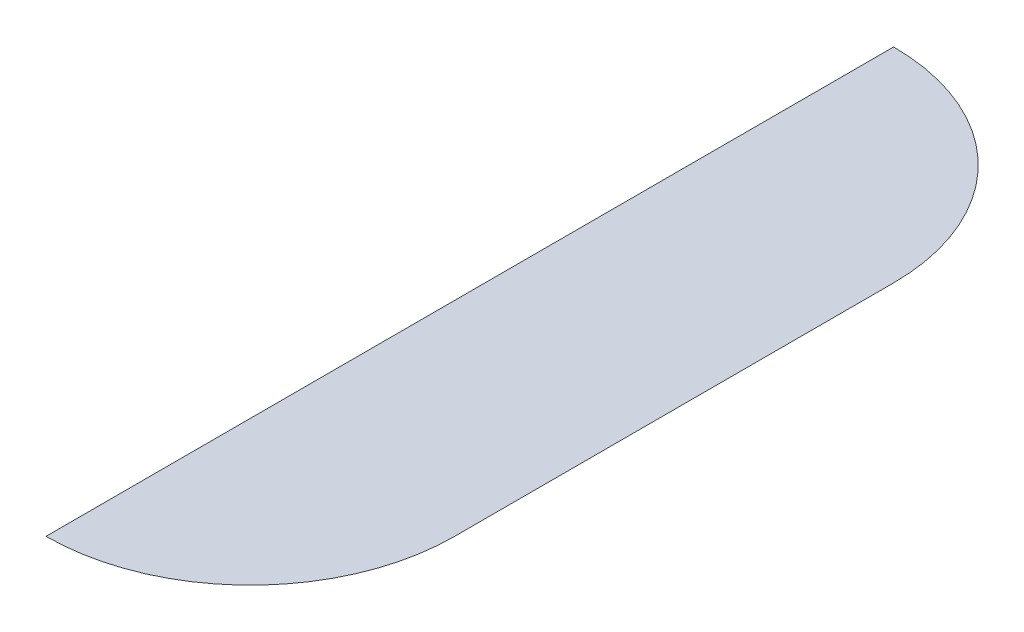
ISO-10303-21;
HEADER;
FILE_DESCRIPTION(('STEP AP214'),'2;1');
FILE_NAME('part.step','',(''),(''),'','','');
FILE_SCHEMA(('AUTOMOTIVE_DESIGN { 1 0 10303 214 1 1 1 1 }'));
ENDSEC;
DATA;
#1=APPLICATION_CONTEXT('core data for automotive mechanical design processes');
#2=APPLICATION_PROTOCOL_DEFINITION('international standard','automotive_design',2000,#1);
#3=PRODUCT_CONTEXT('',#1,'mechanical');
#4=PRODUCT('Part','Part','',(#3));
#5=PRODUCT_RELATED_PRODUCT_CATEGORY('part','',(#4));
#6=PRODUCT_DEFINITION_FORMATION('','',#4);
#7=PRODUCT_DEFINITION_CONTEXT('part definition',#1,'design');
#8=PRODUCT_DEFINITION('design','',#6,#7);
#9=PRODUCT_DEFINITION_SHAPE('','',#8);
#10=(LENGTH_UNIT() NAMED_UNIT(*) SI_UNIT(.MILLI.,.METRE.));
#11=(NAMED_UNIT(*) PLANE_ANGLE_UNIT() SI_UNIT($,.RADIAN.));
#12=(NAMED_UNIT(*) SI_UNIT($,.STERADIAN.) SOLID_ANGLE_UNIT());
#13=UNCERTAINTY_MEASURE_WITH_UNIT(LENGTH_MEASURE(1.E-05),#10,'distance_accuracy_value','');
#14=(GEOMETRIC_REPRESENTATION_CONTEXT(3) GLOBAL_UNCERTAINTY_ASSIGNED_CONTEXT((#13)) GLOBAL_UNIT_ASSIGNED_CONTEXT((#10,
#11,#12)) REPRESENTATION_CONTEXT('',''));
#15=CARTESIAN_POINT('',(0.,0.,0.));
#16=DIRECTION('',(0.,0.,1.));
#17=DIRECTION('',(1.,0.,0.));
#18=AXIS2_PLACEMENT_3D('',#15,#16,#17);
#19=CARTESIAN_POINT('',(-5.47370000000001,0.,12.7));
#20=DIRECTION('',(1.,0.,0.));
#21=DIRECTION('',(0.,0.,-1.));
#22=AXIS2_PLACEMENT_3D('',#19,#20,#21);
#23=PLANE('',#22);
#24=DIRECTION('',(0.,0.,-1.));
#25=VECTOR('',#24,1.);
#26=CARTESIAN_POINT('',(-5.47370000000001,0.,12.7));
#27=LINE('',#26,#25);
#28=CARTESIAN_POINT('',(-5.47370000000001,0.,24.5248117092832));
#29=VERTEX_POINT('',#28);
#30=CARTESIAN_POINT('',(-5.47370000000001,0.,-24.5248117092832));
#31=VERTEX_POINT('',#30);
#32=EDGE_CURVE('E93',#29,#31,#27,.T.);
#33=ORIENTED_EDGE('',*,*,#32,.T.);
#34=CARTESIAN_POINT('',(-5.47370000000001,-2.0701,-24.5248117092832));
#35=DIRECTION('',(1.,0.,0.));
#36=DIRECTION('',(0.,0.,-1.));
#37=AXIS2_PLACEMENT_3D('',#34,#35,#36);
#38=CIRCLE('',#37,2.0701);
#39=CARTESIAN_POINT('',(-5.47370000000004,-0.591150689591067,-23.0763563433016));
#40=VERTEX_POINT('',#39);
#41=EDGE_CURVE('E11',#31,#40,#38,.T.);
#42=ORIENTED_EDGE('',*,*,#41,.T.);
#43=CARTESIAN_POINT('',(-5.47370000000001,10.0036563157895,-12.7));
#44=DIRECTION('',(-1.,0.,0.));
#45=DIRECTION('',(0.,0.,1.));
#46=AXIS2_PLACEMENT_3D('',#43,#44,#45);
#47=CIRCLE('',#46,14.8296563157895);
#48=CARTESIAN_POINT('',(-5.47370000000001,-4.826,-12.7));
#49=VERTEX_POINT('',#48);
#50=EDGE_CURVE('E126',#40,#49,#47,.T.);
#51=ORIENTED_EDGE('',*,*,#50,.T.);
#52=DIRECTION('',(0.,0.,-1.));
#53=VECTOR('',#52,1.);
#54=CARTESIAN_POINT('',(-5.47370000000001,-4.826,12.7));
#55=LINE('',#54,#53);
#56=CARTESIAN_POINT('',(-5.47370000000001,-4.826,12.7));
#57=VERTEX_POINT('',#56);
#58=EDGE_CURVE('E122',#57,#49,#55,.T.);
#59=ORIENTED_EDGE('',*,*,#58,.F.);
#60=CARTESIAN_POINT('',(-5.47370000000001,10.0036563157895,12.7));
#61=DIRECTION('',(-1.,0.,0.));
#62=DIRECTION('',(0.,0.,1.));
#63=AXIS2_PLACEMENT_3D('',#60,#61,#62);
#64=CIRCLE('',#63,14.8296563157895);
#65=CARTESIAN_POINT('',(-5.47370000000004,-0.591150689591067,23.0763563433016));
#66=VERTEX_POINT('',#65);
#67=EDGE_CURVE('E120',#57,#66,#64,.T.);
#68=ORIENTED_EDGE('',*,*,#67,.T.);
#69=CARTESIAN_POINT('',(-5.47370000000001,-2.0701,24.5248117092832));
#70=DIRECTION('',(1.,0.,0.));
#71=DIRECTION('',(0.,0.,-1.));
#72=AXIS2_PLACEMENT_3D('',#69,#70,#71);
#73=CIRCLE('',#72,2.0701);
#74=EDGE_CURVE('E48',#66,#29,#73,.T.);
#75=ORIENTED_EDGE('',*,*,#74,.T.);
#76=EDGE_LOOP('',(#33,#42,#51,#59,#68,#75));
#77=FACE_BOUND('',#76,.T.);
#78=ADVANCED_FACE('F39',(#77),#23,.F.);
#79=CARTESIAN_POINT('',(-5.47370000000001,10.0036563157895,12.7));
#80=DIRECTION('',(0.,0.,-1.));
#81=DIRECTION('',(-1.,0.,0.));
#82=AXIS2_PLACEMENT_3D('',#79,#80,#81);
#83=CYLINDRICAL_SURFACE('',#82,14.8296563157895);
#84=CARTESIAN_POINT('',(-5.47370000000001,10.0036563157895,-12.7));
#85=DIRECTION('',(0.,0.,-1.));
#86=DIRECTION('',(-1.,0.,0.));
#87=AXIS2_PLACEMENT_3D('',#84,#85,#86);
#88=CIRCLE('',#87,14.8296563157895);
#89=CARTESIAN_POINT('',(4.90265634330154,-0.59115068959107,-12.7));
#90=VERTEX_POINT('',#89);
#91=EDGE_CURVE('E125',#90,#49,#88,.T.);
#92=ORIENTED_EDGE('',*,*,#91,.F.);
#93=DIRECTION('',(0.,0.,-1.));
#94=VECTOR('',#93,1.);
#95=CARTESIAN_POINT('',(4.90265634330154,-0.591150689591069,12.7));
#96=LINE('',#95,#94);
#97=CARTESIAN_POINT('',(4.90265634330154,-0.59115068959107,12.7));
#98=VERTEX_POINT('',#97);
#99=EDGE_CURVE('E114',#90,#98,#96,.F.);
#100=ORIENTED_EDGE('',*,*,#99,.T.);
#101=CARTESIAN_POINT('',(-5.47370000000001,10.0036563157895,12.7));
#102=DIRECTION('',(0.,0.,-1.));
#103=DIRECTION('',(-1.,0.,0.));
#104=AXIS2_PLACEMENT_3D('',#101,#102,#103);
#105=CIRCLE('',#104,14.8296563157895);
#106=EDGE_CURVE('E128',#98,#57,#105,.T.);
#107=ORIENTED_EDGE('',*,*,#106,.T.);
#108=ORIENTED_EDGE('',*,*,#58,.T.);
#109=EDGE_LOOP('',(#92,#100,#107,#108));
#110=FACE_BOUND('',#109,.T.);
#111=ADVANCED_FACE('F134',(#110),#83,.T.);
#112=CARTESIAN_POINT('',(-5.47370000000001,10.0036563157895,12.7));
#113=DIRECTION('',(0.,1.,0.));
#114=DIRECTION('',(0.,0.,-1.));
#115=AXIS2_PLACEMENT_3D('',#112,#113,#114);
#116=SPHERICAL_SURFACE('',#115,14.8296563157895);
#117=ORIENTED_EDGE('',*,*,#106,.F.);
#118=CARTESIAN_POINT('',(-5.47370000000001,-0.591150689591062,12.7));
#119=DIRECTION('',(0.,1.,0.));
#120=DIRECTION('',(0.,0.,1.));
#121=AXIS2_PLACEMENT_3D('',#118,#119,#120);
#122=CIRCLE('',#121,10.3763563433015);
#123=EDGE_CURVE('E97',#98,#66,#122,.F.);
#124=ORIENTED_EDGE('',*,*,#123,.T.);
#125=ORIENTED_EDGE('',*,*,#67,.F.);
#126=EDGE_LOOP('',(#117,#124,#125));
#127=FACE_BOUND('',#126,.T.);
#128=ADVANCED_FACE('F135',(#127),#116,.T.);
#129=CARTESIAN_POINT('',(-5.47370000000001,10.0036563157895,-12.7));
#130=DIRECTION('',(0.,-1.,0.));
#131=DIRECTION('',(0.,0.,-1.));
#132=AXIS2_PLACEMENT_3D('',#129,#130,#131);
#133=SPHERICAL_SURFACE('',#132,14.8296563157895);
#134=ORIENTED_EDGE('',*,*,#50,.F.);
#135=CARTESIAN_POINT('',(-5.47370000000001,-0.591150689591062,-12.7));
#136=DIRECTION('',(0.,1.,0.));
#137=DIRECTION('',(0.,0.,1.));
#138=AXIS2_PLACEMENT_3D('',#135,#136,#137);
#139=CIRCLE('',#138,10.3763563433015);
#140=EDGE_CURVE('E61',#40,#90,#139,.F.);
#141=ORIENTED_EDGE('',*,*,#140,.T.);
#142=ORIENTED_EDGE('',*,*,#91,.T.);
#143=EDGE_LOOP('',(#134,#141,#142));
#144=FACE_BOUND('',#143,.T.);
#145=ADVANCED_FACE('F137',(#144),#133,.T.);
#146=CARTESIAN_POINT('',(-5.47370000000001,-2.0701,-12.7));
#147=DIRECTION('',(0.,1.,0.));
#148=DIRECTION('',(0.,0.,1.));
#149=AXIS2_PLACEMENT_3D('',#146,#147,#148);
#150=TOROIDAL_SURFACE('',#149,11.8248117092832,2.0701);
#151=ORIENTED_EDGE('',*,*,#41,.F.);
#152=CARTESIAN_POINT('',(-5.47370000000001,0.,-12.7));
#153=DIRECTION('',(0.,1.,0.));
#154=DIRECTION('',(0.,0.,1.));
#155=AXIS2_PLACEMENT_3D('',#152,#153,#154);
#156=CIRCLE('',#155,11.8248117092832);
#157=CARTESIAN_POINT('',(6.35111170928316,0.,-12.7));
#158=VERTEX_POINT('',#157);
#159=EDGE_CURVE('E108',#158,#31,#156,.T.);
#160=ORIENTED_EDGE('',*,*,#159,.F.);
#161=CARTESIAN_POINT('',(6.35111170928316,-2.0701,-12.7));
#162=DIRECTION('',(0.,0.,-1.));
#163=DIRECTION('',(-1.,0.,0.));
#164=AXIS2_PLACEMENT_3D('',#161,#162,#163);
#165=CIRCLE('',#164,2.0701);
#166=EDGE_CURVE('E43',#90,#158,#165,.T.);
#167=ORIENTED_EDGE('',*,*,#166,.F.);
#168=ORIENTED_EDGE('',*,*,#140,.F.);
#169=EDGE_LOOP('',(#151,#160,#167,#168));
#170=FACE_BOUND('',#169,.T.);
#171=ADVANCED_FACE('F41',(#170),#150,.F.);
#172=CARTESIAN_POINT('',(6.35111170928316,-2.0701,12.7));
#173=DIRECTION('',(0.,0.,-1.));
#174=DIRECTION('',(-1.,0.,0.));
#175=AXIS2_PLACEMENT_3D('',#172,#173,#174);
#176=CYLINDRICAL_SURFACE('',#175,2.0701);
#177=ORIENTED_EDGE('',*,*,#166,.T.);
#178=DIRECTION('',(0.,0.,-1.));
#179=VECTOR('',#178,1.);
#180=CARTESIAN_POINT('',(6.35111170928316,0.,38.1));
#181=LINE('',#180,#179);
#182=CARTESIAN_POINT('',(6.35111170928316,0.,12.7));
#183=VERTEX_POINT('',#182);
#184=EDGE_CURVE('E91',#183,#158,#181,.T.);
#185=ORIENTED_EDGE('',*,*,#184,.F.);
#186=CARTESIAN_POINT('',(6.35111170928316,-2.0701,12.7));
#187=DIRECTION('',(0.,0.,-1.));
#188=DIRECTION('',(-1.,0.,0.));
#189=AXIS2_PLACEMENT_3D('',#186,#187,#188);
#190=CIRCLE('',#189,2.0701);
#191=EDGE_CURVE('E101',#98,#183,#190,.T.);
#192=ORIENTED_EDGE('',*,*,#191,.F.);
#193=ORIENTED_EDGE('',*,*,#99,.F.);
#194=EDGE_LOOP('',(#177,#185,#192,#193));
#195=FACE_BOUND('',#194,.T.);
#196=ADVANCED_FACE('F106',(#195),#176,.F.);
#197=CARTESIAN_POINT('',(-5.47370000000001,-2.0701,12.7));
#198=DIRECTION('',(0.,1.,0.));
#199=DIRECTION('',(0.,0.,1.));
#200=AXIS2_PLACEMENT_3D('',#197,#198,#199);
#201=TOROIDAL_SURFACE('',#200,11.8248117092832,2.0701);
#202=ORIENTED_EDGE('',*,*,#74,.F.);
#203=ORIENTED_EDGE('',*,*,#123,.F.);
#204=ORIENTED_EDGE('',*,*,#191,.T.);
#205=CARTESIAN_POINT('',(-5.47370000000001,0.,12.7));
#206=DIRECTION('',(0.,1.,0.));
#207=DIRECTION('',(0.,0.,1.));
#208=AXIS2_PLACEMENT_3D('',#205,#206,#207);
#209=CIRCLE('',#208,11.8248117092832);
#210=EDGE_CURVE('E87',#29,#183,#209,.T.);
#211=ORIENTED_EDGE('',*,*,#210,.F.);
#212=EDGE_LOOP('',(#202,#203,#204,#211));
#213=FACE_BOUND('',#212,.T.);
#214=ADVANCED_FACE('F102',(#213),#201,.F.);
#215=CARTESIAN_POINT('',(15.,0.,-38.1));
#216=DIRECTION('',(0.,-1.,0.));
#217=DIRECTION('',(0.,0.,-1.));
#218=AXIS2_PLACEMENT_3D('',#215,#216,#217);
#219=PLANE('',#218);
#220=ORIENTED_EDGE('',*,*,#210,.T.);
#221=ORIENTED_EDGE('',*,*,#184,.T.);
#222=ORIENTED_EDGE('',*,*,#159,.T.);
#223=ORIENTED_EDGE('',*,*,#32,.F.);
#224=EDGE_LOOP('',(#220,#221,#222,#223));
#225=FACE_BOUND('',#224,.T.);
#226=ADVANCED_FACE('F89',(#225),#219,.F.);
#227=CLOSED_SHELL('',(#78,#111,#128,#145,#171,#196,#214,#226));
#228=MANIFOLD_SOLID_BREP('B2',#227);
#229=ADVANCED_BREP_SHAPE_REPRESENTATION('',(#18,#228),#14);
#230=SHAPE_DEFINITION_REPRESENTATION(#9,#229);
ENDSEC;
END-ISO-10303-21;
